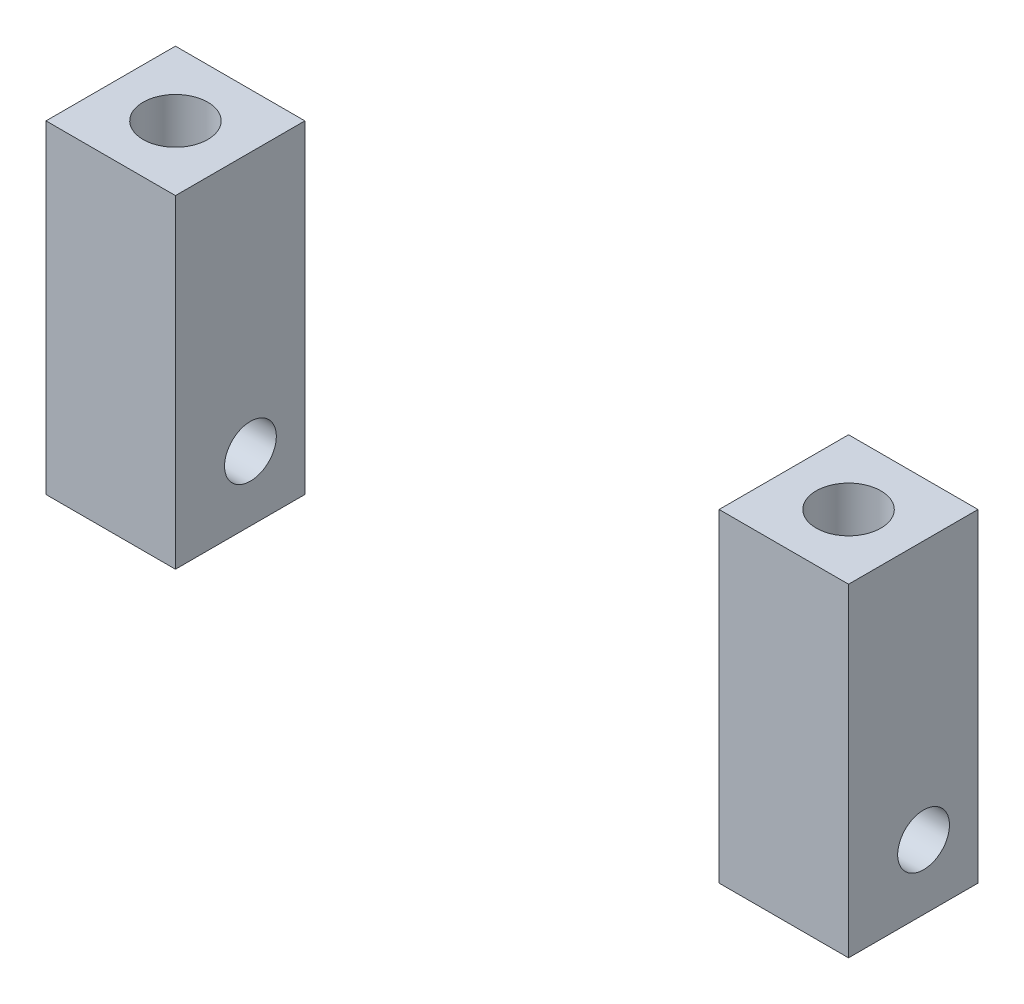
ISO-10303-21;
HEADER;
FILE_DESCRIPTION(('STEP AP214'),'2;1');
FILE_NAME('part.step','',(''),(''),'','','');
FILE_SCHEMA(('AUTOMOTIVE_DESIGN { 1 0 10303 214 1 1 1 1 }'));
ENDSEC;
DATA;
#1=APPLICATION_CONTEXT('core data for automotive mechanical design processes');
#2=APPLICATION_PROTOCOL_DEFINITION('international standard','automotive_design',2000,#1);
#3=PRODUCT_CONTEXT('',#1,'mechanical');
#4=PRODUCT('Part','Part','',(#3));
#5=PRODUCT_RELATED_PRODUCT_CATEGORY('part','',(#4));
#6=PRODUCT_DEFINITION_FORMATION('','',#4);
#7=PRODUCT_DEFINITION_CONTEXT('part definition',#1,'design');
#8=PRODUCT_DEFINITION('design','',#6,#7);
#9=PRODUCT_DEFINITION_SHAPE('','',#8);
#10=(LENGTH_UNIT() NAMED_UNIT(*) SI_UNIT(.MILLI.,.METRE.));
#11=(NAMED_UNIT(*) PLANE_ANGLE_UNIT() SI_UNIT($,.RADIAN.));
#12=(NAMED_UNIT(*) SI_UNIT($,.STERADIAN.) SOLID_ANGLE_UNIT());
#13=UNCERTAINTY_MEASURE_WITH_UNIT(LENGTH_MEASURE(1.E-05),#10,'distance_accuracy_value','');
#14=(GEOMETRIC_REPRESENTATION_CONTEXT(3) GLOBAL_UNCERTAINTY_ASSIGNED_CONTEXT((#13)) GLOBAL_UNIT_ASSIGNED_CONTEXT((#10,
#11,#12)) REPRESENTATION_CONTEXT('',''));
#15=CARTESIAN_POINT('',(0.,0.,0.));
#16=DIRECTION('',(0.,0.,1.));
#17=DIRECTION('',(1.,0.,0.));
#18=AXIS2_PLACEMENT_3D('',#15,#16,#17);
#19=CARTESIAN_POINT('',(-38.1949667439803,25.,-4.20544560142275));
#20=DIRECTION('',(-1.,0.,0.));
#21=DIRECTION('',(0.,0.,1.));
#22=AXIS2_PLACEMENT_3D('',#19,#20,#21);
#23=PLANE('',#22);
#24=CARTESIAN_POINT('',(-38.1949667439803,5.,0.));
#25=DIRECTION('',(-1.,0.,0.));
#26=DIRECTION('',(0.,0.,1.));
#27=AXIS2_PLACEMENT_3D('',#24,#25,#26);
#28=CIRCLE('',#27,2.);
#29=CARTESIAN_POINT('',(-38.1949667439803,5.,2.));
#30=VERTEX_POINT('',#29);
#31=EDGE_CURVE('E122',#30,#30,#28,.T.);
#32=ORIENTED_EDGE('',*,*,#31,.T.);
#33=EDGE_LOOP('',(#32));
#34=FACE_BOUND('',#33,.T.);
#35=DIRECTION('',(0.,0.,-1.));
#36=VECTOR('',#35,1.);
#37=CARTESIAN_POINT('',(-38.1949667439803,0.,-4.20544560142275));
#38=LINE('',#37,#36);
#39=CARTESIAN_POINT('',(-38.1949667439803,0.,5.79455439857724));
#40=VERTEX_POINT('',#39);
#41=CARTESIAN_POINT('',(-38.1949667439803,0.,-4.20544560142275));
#42=VERTEX_POINT('',#41);
#43=EDGE_CURVE('E105',#40,#42,#38,.T.);
#44=ORIENTED_EDGE('',*,*,#43,.T.);
#45=DIRECTION('',(0.,-1.,0.));
#46=VECTOR('',#45,1.);
#47=CARTESIAN_POINT('',(-38.1949667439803,25.,-4.20544560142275));
#48=LINE('',#47,#46);
#49=CARTESIAN_POINT('',(-38.1949667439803,25.,-4.20544560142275));
#50=VERTEX_POINT('',#49);
#51=EDGE_CURVE('E12',#50,#42,#48,.T.);
#52=ORIENTED_EDGE('',*,*,#51,.F.);
#53=DIRECTION('',(0.,0.,-1.));
#54=VECTOR('',#53,1.);
#55=CARTESIAN_POINT('',(-38.1949667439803,25.,-4.20544560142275));
#56=LINE('',#55,#54);
#57=CARTESIAN_POINT('',(-38.1949667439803,25.,5.79455439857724));
#58=VERTEX_POINT('',#57);
#59=EDGE_CURVE('E93',#58,#50,#56,.T.);
#60=ORIENTED_EDGE('',*,*,#59,.F.);
#61=DIRECTION('',(0.,-1.,0.));
#62=VECTOR('',#61,1.);
#63=CARTESIAN_POINT('',(-38.1949667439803,25.,5.79455439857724));
#64=LINE('',#63,#62);
#65=EDGE_CURVE('E101',#58,#40,#64,.T.);
#66=ORIENTED_EDGE('',*,*,#65,.T.);
#67=EDGE_LOOP('',(#44,#52,#60,#66));
#68=FACE_BOUND('',#67,.T.);
#69=ADVANCED_FACE('F42',(#34,#68),#23,.F.);
#70=CARTESIAN_POINT('',(-48.1949667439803,25.,-4.20544560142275));
#71=DIRECTION('',(0.,0.,1.));
#72=DIRECTION('',(1.,0.,0.));
#73=AXIS2_PLACEMENT_3D('',#70,#71,#72);
#74=PLANE('',#73);
#75=DIRECTION('',(-1.,0.,0.));
#76=VECTOR('',#75,1.);
#77=CARTESIAN_POINT('',(-48.1949667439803,0.,-4.20544560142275));
#78=LINE('',#77,#76);
#79=CARTESIAN_POINT('',(-48.1949667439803,0.,-4.20544560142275));
#80=VERTEX_POINT('',#79);
#81=EDGE_CURVE('E97',#42,#80,#78,.T.);
#82=ORIENTED_EDGE('',*,*,#81,.T.);
#83=DIRECTION('',(0.,-1.,0.));
#84=VECTOR('',#83,1.);
#85=CARTESIAN_POINT('',(-48.1949667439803,25.,-4.20544560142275));
#86=LINE('',#85,#84);
#87=CARTESIAN_POINT('',(-48.1949667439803,25.,-4.20544560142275));
#88=VERTEX_POINT('',#87);
#89=EDGE_CURVE('E50',#88,#80,#86,.T.);
#90=ORIENTED_EDGE('',*,*,#89,.F.);
#91=DIRECTION('',(-1.,0.,0.));
#92=VECTOR('',#91,1.);
#93=CARTESIAN_POINT('',(-48.1949667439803,25.,-4.20544560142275));
#94=LINE('',#93,#92);
#95=EDGE_CURVE('E88',#50,#88,#94,.T.);
#96=ORIENTED_EDGE('',*,*,#95,.F.);
#97=ORIENTED_EDGE('',*,*,#51,.T.);
#98=EDGE_LOOP('',(#82,#90,#96,#97));
#99=FACE_BOUND('',#98,.T.);
#100=ADVANCED_FACE('F96',(#99),#74,.F.);
#101=CARTESIAN_POINT('',(-48.1949667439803,25.,-4.20544560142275));
#102=DIRECTION('',(1.,0.,0.));
#103=DIRECTION('',(0.,0.,-1.));
#104=AXIS2_PLACEMENT_3D('',#101,#102,#103);
#105=PLANE('',#104);
#106=CARTESIAN_POINT('',(-48.1949667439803,5.,0.));
#107=DIRECTION('',(1.,0.,0.));
#108=DIRECTION('',(0.,0.,-1.));
#109=AXIS2_PLACEMENT_3D('',#106,#107,#108);
#110=CIRCLE('',#109,2.);
#111=CARTESIAN_POINT('',(-48.1949667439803,5.,-2.));
#112=VERTEX_POINT('',#111);
#113=EDGE_CURVE('E127',#112,#112,#110,.T.);
#114=ORIENTED_EDGE('',*,*,#113,.T.);
#115=EDGE_LOOP('',(#114));
#116=FACE_BOUND('',#115,.T.);
#117=DIRECTION('',(0.,0.,1.));
#118=VECTOR('',#117,1.);
#119=CARTESIAN_POINT('',(-48.1949667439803,0.,-4.20544560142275));
#120=LINE('',#119,#118);
#121=CARTESIAN_POINT('',(-48.1949667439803,0.,5.79455439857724));
#122=VERTEX_POINT('',#121);
#123=EDGE_CURVE('E75',#80,#122,#120,.T.);
#124=ORIENTED_EDGE('',*,*,#123,.T.);
#125=DIRECTION('',(0.,-1.,0.));
#126=VECTOR('',#125,1.);
#127=CARTESIAN_POINT('',(-48.1949667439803,25.,5.79455439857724));
#128=LINE('',#127,#126);
#129=CARTESIAN_POINT('',(-48.1949667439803,25.,5.79455439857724));
#130=VERTEX_POINT('',#129);
#131=EDGE_CURVE('E98',#130,#122,#128,.T.);
#132=ORIENTED_EDGE('',*,*,#131,.F.);
#133=DIRECTION('',(0.,0.,1.));
#134=VECTOR('',#133,1.);
#135=CARTESIAN_POINT('',(-48.1949667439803,25.,-4.20544560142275));
#136=LINE('',#135,#134);
#137=EDGE_CURVE('E91',#88,#130,#136,.T.);
#138=ORIENTED_EDGE('',*,*,#137,.F.);
#139=ORIENTED_EDGE('',*,*,#89,.T.);
#140=EDGE_LOOP('',(#124,#132,#138,#139));
#141=FACE_BOUND('',#140,.T.);
#142=ADVANCED_FACE('F99',(#116,#141),#105,.F.);
#143=CARTESIAN_POINT('',(-48.1949667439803,25.,5.79455439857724));
#144=DIRECTION('',(0.,0.,-1.));
#145=DIRECTION('',(-1.,0.,0.));
#146=AXIS2_PLACEMENT_3D('',#143,#144,#145);
#147=PLANE('',#146);
#148=DIRECTION('',(1.,0.,0.));
#149=VECTOR('',#148,1.);
#150=CARTESIAN_POINT('',(-48.1949667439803,0.,5.79455439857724));
#151=LINE('',#150,#149);
#152=EDGE_CURVE('E81',#122,#40,#151,.T.);
#153=ORIENTED_EDGE('',*,*,#152,.T.);
#154=ORIENTED_EDGE('',*,*,#65,.F.);
#155=DIRECTION('',(1.,0.,0.));
#156=VECTOR('',#155,1.);
#157=CARTESIAN_POINT('',(-48.1949667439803,25.,5.79455439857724));
#158=LINE('',#157,#156);
#159=EDGE_CURVE('E58',#130,#58,#158,.T.);
#160=ORIENTED_EDGE('',*,*,#159,.F.);
#161=ORIENTED_EDGE('',*,*,#131,.T.);
#162=EDGE_LOOP('',(#153,#154,#160,#161));
#163=FACE_BOUND('',#162,.T.);
#164=ADVANCED_FACE('F113',(#163),#147,.F.);
#165=CARTESIAN_POINT('',(0.,25.,0.));
#166=DIRECTION('',(0.,1.,0.));
#167=DIRECTION('',(0.,0.,1.));
#168=AXIS2_PLACEMENT_3D('',#165,#166,#167);
#169=PLANE('',#168);
#170=CARTESIAN_POINT('',(-43.1949667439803,25.,0.794554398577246));
#171=DIRECTION('',(0.,1.,0.));
#172=DIRECTION('',(0.,0.,1.));
#173=AXIS2_PLACEMENT_3D('',#170,#171,#172);
#174=CIRCLE('',#173,2.5);
#175=CARTESIAN_POINT('',(-43.1949667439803,25.,3.29455439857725));
#176=VERTEX_POINT('',#175);
#177=EDGE_CURVE('E119',#176,#176,#174,.T.);
#178=ORIENTED_EDGE('',*,*,#177,.F.);
#179=EDGE_LOOP('',(#178));
#180=FACE_BOUND('',#179,.T.);
#181=ORIENTED_EDGE('',*,*,#59,.T.);
#182=ORIENTED_EDGE('',*,*,#95,.T.);
#183=ORIENTED_EDGE('',*,*,#137,.T.);
#184=ORIENTED_EDGE('',*,*,#159,.T.);
#185=EDGE_LOOP('',(#181,#182,#183,#184));
#186=FACE_BOUND('',#185,.T.);
#187=ADVANCED_FACE('F89',(#180,#186),#169,.T.);
#188=CARTESIAN_POINT('',(0.,0.,0.));
#189=DIRECTION('',(0.,1.,0.));
#190=DIRECTION('',(0.,0.,1.));
#191=AXIS2_PLACEMENT_3D('',#188,#189,#190);
#192=PLANE('',#191);
#193=ORIENTED_EDGE('',*,*,#43,.F.);
#194=ORIENTED_EDGE('',*,*,#152,.F.);
#195=ORIENTED_EDGE('',*,*,#123,.F.);
#196=ORIENTED_EDGE('',*,*,#81,.F.);
#197=EDGE_LOOP('',(#193,#194,#195,#196));
#198=FACE_BOUND('',#197,.T.);
#199=ADVANCED_FACE('F116',(#198),#192,.F.);
#200=CARTESIAN_POINT('',(-43.1949667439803,10.,0.794554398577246));
#201=DIRECTION('',(0.,1.,0.));
#202=DIRECTION('',(0.,0.,1.));
#203=AXIS2_PLACEMENT_3D('',#200,#201,#202);
#204=CYLINDRICAL_SURFACE('',#203,2.5);
#205=CARTESIAN_POINT('',(-43.1949667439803,10.,0.794554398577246));
#206=DIRECTION('',(0.,1.,0.));
#207=DIRECTION('',(0.,0.,1.));
#208=AXIS2_PLACEMENT_3D('',#205,#206,#207);
#209=CIRCLE('',#208,2.5);
#210=CARTESIAN_POINT('',(-43.1949667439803,10.,3.29455439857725));
#211=VERTEX_POINT('',#210);
#212=EDGE_CURVE('E108',#211,#211,#209,.T.);
#213=ORIENTED_EDGE('',*,*,#212,.F.);
#214=EDGE_LOOP('',(#213));
#215=FACE_BOUND('',#214,.T.);
#216=ORIENTED_EDGE('',*,*,#177,.T.);
#217=EDGE_LOOP('',(#216));
#218=FACE_BOUND('',#217,.T.);
#219=ADVANCED_FACE('F152',(#215,#218),#204,.F.);
#220=CARTESIAN_POINT('',(-43.1949667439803,10.,0.794554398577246));
#221=DIRECTION('',(0.,1.,0.));
#222=DIRECTION('',(0.,0.,1.));
#223=AXIS2_PLACEMENT_3D('',#220,#221,#222);
#224=PLANE('',#223);
#225=ORIENTED_EDGE('',*,*,#212,.T.);
#226=EDGE_LOOP('',(#225));
#227=FACE_BOUND('',#226,.T.);
#228=ADVANCED_FACE('F135',(#227),#224,.T.);
#229=CARTESIAN_POINT('',(-48.1949667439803,5.,0.));
#230=DIRECTION('',(1.,0.,0.));
#231=DIRECTION('',(0.,0.,-1.));
#232=AXIS2_PLACEMENT_3D('',#229,#230,#231);
#233=CYLINDRICAL_SURFACE('',#232,2.);
#234=ORIENTED_EDGE('',*,*,#113,.F.);
#235=EDGE_LOOP('',(#234));
#236=FACE_BOUND('',#235,.T.);
#237=ORIENTED_EDGE('',*,*,#31,.F.);
#238=EDGE_LOOP('',(#237));
#239=FACE_BOUND('',#238,.T.);
#240=ADVANCED_FACE('F132',(#236,#239),#233,.F.);
#241=CLOSED_SHELL('',(#69,#100,#142,#164,#187,#199,#219,#228,#240));
#242=MANIFOLD_SOLID_BREP('B2',#241);
#243=CARTESIAN_POINT('',(13.8050332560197,25.,-4.20544560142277));
#244=DIRECTION('',(-1.,0.,0.));
#245=DIRECTION('',(0.,0.,1.));
#246=AXIS2_PLACEMENT_3D('',#243,#244,#245);
#247=PLANE('',#246);
#248=CARTESIAN_POINT('',(13.8050332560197,5.,0.));
#249=DIRECTION('',(1.,0.,0.));
#250=DIRECTION('',(0.,0.,-1.));
#251=AXIS2_PLACEMENT_3D('',#248,#249,#250);
#252=CIRCLE('',#251,2.);
#253=CARTESIAN_POINT('',(13.8050332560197,5.,-2.));
#254=VERTEX_POINT('',#253);
#255=EDGE_CURVE('E300',#254,#254,#252,.T.);
#256=ORIENTED_EDGE('',*,*,#255,.F.);
#257=EDGE_LOOP('',(#256));
#258=FACE_BOUND('',#257,.T.);
#259=DIRECTION('',(0.,0.,-1.));
#260=VECTOR('',#259,1.);
#261=CARTESIAN_POINT('',(13.8050332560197,0.,-4.20544560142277));
#262=LINE('',#261,#260);
#263=CARTESIAN_POINT('',(13.8050332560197,0.,5.79455439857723));
#264=VERTEX_POINT('',#263);
#265=CARTESIAN_POINT('',(13.8050332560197,0.,-4.20544560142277));
#266=VERTEX_POINT('',#265);
#267=EDGE_CURVE('E281',#264,#266,#262,.T.);
#268=ORIENTED_EDGE('',*,*,#267,.T.);
#269=DIRECTION('',(0.,-1.,0.));
#270=VECTOR('',#269,1.);
#271=CARTESIAN_POINT('',(13.8050332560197,25.,-4.20544560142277));
#272=LINE('',#271,#270);
#273=CARTESIAN_POINT('',(13.8050332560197,25.,-4.20544560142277));
#274=VERTEX_POINT('',#273);
#275=EDGE_CURVE('E40',#274,#266,#272,.T.);
#276=ORIENTED_EDGE('',*,*,#275,.F.);
#277=DIRECTION('',(0.,0.,-1.));
#278=VECTOR('',#277,1.);
#279=CARTESIAN_POINT('',(13.8050332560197,25.,-4.20544560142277));
#280=LINE('',#279,#278);
#281=CARTESIAN_POINT('',(13.8050332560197,25.,5.79455439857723));
#282=VERTEX_POINT('',#281);
#283=EDGE_CURVE('E268',#282,#274,#280,.T.);
#284=ORIENTED_EDGE('',*,*,#283,.F.);
#285=DIRECTION('',(0.,-1.,0.));
#286=VECTOR('',#285,1.);
#287=CARTESIAN_POINT('',(13.8050332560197,25.,5.79455439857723));
#288=LINE('',#287,#286);
#289=EDGE_CURVE('E277',#282,#264,#288,.T.);
#290=ORIENTED_EDGE('',*,*,#289,.T.);
#291=EDGE_LOOP('',(#268,#276,#284,#290));
#292=FACE_BOUND('',#291,.T.);
#293=ADVANCED_FACE('F216',(#258,#292),#247,.F.);
#294=CARTESIAN_POINT('',(13.8050332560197,25.,-4.20544560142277));
#295=DIRECTION('',(0.,0.,1.));
#296=DIRECTION('',(1.,0.,0.));
#297=AXIS2_PLACEMENT_3D('',#294,#295,#296);
#298=PLANE('',#297);
#299=DIRECTION('',(-1.,0.,0.));
#300=VECTOR('',#299,1.);
#301=CARTESIAN_POINT('',(13.8050332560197,0.,-4.20544560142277));
#302=LINE('',#301,#300);
#303=CARTESIAN_POINT('',(3.80503325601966,0.,-4.20544560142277));
#304=VERTEX_POINT('',#303);
#305=EDGE_CURVE('E272',#266,#304,#302,.T.);
#306=ORIENTED_EDGE('',*,*,#305,.T.);
#307=DIRECTION('',(0.,-1.,0.));
#308=VECTOR('',#307,1.);
#309=CARTESIAN_POINT('',(3.80503325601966,25.,-4.20544560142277));
#310=LINE('',#309,#308);
#311=CARTESIAN_POINT('',(3.80503325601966,25.,-4.20544560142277));
#312=VERTEX_POINT('',#311);
#313=EDGE_CURVE('E225',#312,#304,#310,.T.);
#314=ORIENTED_EDGE('',*,*,#313,.F.);
#315=DIRECTION('',(-1.,0.,0.));
#316=VECTOR('',#315,1.);
#317=CARTESIAN_POINT('',(13.8050332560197,25.,-4.20544560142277));
#318=LINE('',#317,#316);
#319=EDGE_CURVE('E263',#274,#312,#318,.T.);
#320=ORIENTED_EDGE('',*,*,#319,.F.);
#321=ORIENTED_EDGE('',*,*,#275,.T.);
#322=EDGE_LOOP('',(#306,#314,#320,#321));
#323=FACE_BOUND('',#322,.T.);
#324=ADVANCED_FACE('F271',(#323),#298,.F.);
#325=CARTESIAN_POINT('',(3.80503325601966,25.,-4.20544560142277));
#326=DIRECTION('',(1.,0.,0.));
#327=DIRECTION('',(0.,0.,-1.));
#328=AXIS2_PLACEMENT_3D('',#325,#326,#327);
#329=PLANE('',#328);
#330=CARTESIAN_POINT('',(3.80503325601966,5.,0.));
#331=DIRECTION('',(1.,0.,0.));
#332=DIRECTION('',(0.,0.,-1.));
#333=AXIS2_PLACEMENT_3D('',#330,#331,#332);
#334=CIRCLE('',#333,2.);
#335=CARTESIAN_POINT('',(3.80503325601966,5.,-2.));
#336=VERTEX_POINT('',#335);
#337=EDGE_CURVE('E219',#336,#336,#334,.T.);
#338=ORIENTED_EDGE('',*,*,#337,.T.);
#339=EDGE_LOOP('',(#338));
#340=FACE_BOUND('',#339,.T.);
#341=DIRECTION('',(0.,0.,1.));
#342=VECTOR('',#341,1.);
#343=CARTESIAN_POINT('',(3.80503325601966,0.,-4.20544560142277));
#344=LINE('',#343,#342);
#345=CARTESIAN_POINT('',(3.80503325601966,0.,5.79455439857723));
#346=VERTEX_POINT('',#345);
#347=EDGE_CURVE('E250',#304,#346,#344,.T.);
#348=ORIENTED_EDGE('',*,*,#347,.T.);
#349=DIRECTION('',(0.,-1.,0.));
#350=VECTOR('',#349,1.);
#351=CARTESIAN_POINT('',(3.80503325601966,25.,5.79455439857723));
#352=LINE('',#351,#350);
#353=CARTESIAN_POINT('',(3.80503325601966,25.,5.79455439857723));
#354=VERTEX_POINT('',#353);
#355=EDGE_CURVE('E273',#354,#346,#352,.T.);
#356=ORIENTED_EDGE('',*,*,#355,.F.);
#357=DIRECTION('',(0.,0.,1.));
#358=VECTOR('',#357,1.);
#359=CARTESIAN_POINT('',(3.80503325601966,25.,-4.20544560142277));
#360=LINE('',#359,#358);
#361=EDGE_CURVE('E266',#312,#354,#360,.T.);
#362=ORIENTED_EDGE('',*,*,#361,.F.);
#363=ORIENTED_EDGE('',*,*,#313,.T.);
#364=EDGE_LOOP('',(#348,#356,#362,#363));
#365=FACE_BOUND('',#364,.T.);
#366=ADVANCED_FACE('F275',(#340,#365),#329,.F.);
#367=CARTESIAN_POINT('',(13.8050332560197,25.,5.79455439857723));
#368=DIRECTION('',(0.,0.,-1.));
#369=DIRECTION('',(-1.,0.,0.));
#370=AXIS2_PLACEMENT_3D('',#367,#368,#369);
#371=PLANE('',#370);
#372=DIRECTION('',(1.,0.,0.));
#373=VECTOR('',#372,1.);
#374=CARTESIAN_POINT('',(13.8050332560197,0.,5.79455439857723));
#375=LINE('',#374,#373);
#376=EDGE_CURVE('E256',#346,#264,#375,.T.);
#377=ORIENTED_EDGE('',*,*,#376,.T.);
#378=ORIENTED_EDGE('',*,*,#289,.F.);
#379=DIRECTION('',(1.,0.,0.));
#380=VECTOR('',#379,1.);
#381=CARTESIAN_POINT('',(13.8050332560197,25.,5.79455439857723));
#382=LINE('',#381,#380);
#383=EDGE_CURVE('E233',#354,#282,#382,.T.);
#384=ORIENTED_EDGE('',*,*,#383,.F.);
#385=ORIENTED_EDGE('',*,*,#355,.T.);
#386=EDGE_LOOP('',(#377,#378,#384,#385));
#387=FACE_BOUND('',#386,.T.);
#388=ADVANCED_FACE('F289',(#387),#371,.F.);
#389=CARTESIAN_POINT('',(0.,25.,0.));
#390=DIRECTION('',(0.,-1.,0.));
#391=DIRECTION('',(0.,0.,-1.));
#392=AXIS2_PLACEMENT_3D('',#389,#390,#391);
#393=PLANE('',#392);
#394=CARTESIAN_POINT('',(8.80503325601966,25.,0.794554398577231));
#395=DIRECTION('',(0.,1.,0.));
#396=DIRECTION('',(0.,0.,1.));
#397=AXIS2_PLACEMENT_3D('',#394,#395,#396);
#398=CIRCLE('',#397,2.5);
#399=CARTESIAN_POINT('',(8.80503325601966,25.,3.29455439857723));
#400=VERTEX_POINT('',#399);
#401=EDGE_CURVE('E295',#400,#400,#398,.T.);
#402=ORIENTED_EDGE('',*,*,#401,.F.);
#403=EDGE_LOOP('',(#402));
#404=FACE_BOUND('',#403,.T.);
#405=ORIENTED_EDGE('',*,*,#283,.T.);
#406=ORIENTED_EDGE('',*,*,#319,.T.);
#407=ORIENTED_EDGE('',*,*,#361,.T.);
#408=ORIENTED_EDGE('',*,*,#383,.T.);
#409=EDGE_LOOP('',(#405,#406,#407,#408));
#410=FACE_BOUND('',#409,.T.);
#411=ADVANCED_FACE('F264',(#404,#410),#393,.F.);
#412=CARTESIAN_POINT('',(0.,0.,0.));
#413=DIRECTION('',(0.,-1.,0.));
#414=DIRECTION('',(0.,0.,-1.));
#415=AXIS2_PLACEMENT_3D('',#412,#413,#414);
#416=PLANE('',#415);
#417=ORIENTED_EDGE('',*,*,#267,.F.);
#418=ORIENTED_EDGE('',*,*,#376,.F.);
#419=ORIENTED_EDGE('',*,*,#347,.F.);
#420=ORIENTED_EDGE('',*,*,#305,.F.);
#421=EDGE_LOOP('',(#417,#418,#419,#420));
#422=FACE_BOUND('',#421,.T.);
#423=ADVANCED_FACE('F292',(#422),#416,.T.);
#424=CARTESIAN_POINT('',(8.80503325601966,10.,0.794554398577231));
#425=DIRECTION('',(0.,1.,0.));
#426=DIRECTION('',(0.,0.,1.));
#427=AXIS2_PLACEMENT_3D('',#424,#425,#426);
#428=CYLINDRICAL_SURFACE('',#427,2.5);
#429=CARTESIAN_POINT('',(8.80503325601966,10.,0.794554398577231));
#430=DIRECTION('',(0.,1.,0.));
#431=DIRECTION('',(0.,0.,1.));
#432=AXIS2_PLACEMENT_3D('',#429,#430,#431);
#433=CIRCLE('',#432,2.5);
#434=CARTESIAN_POINT('',(8.80503325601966,10.,3.29455439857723));
#435=VERTEX_POINT('',#434);
#436=EDGE_CURVE('E284',#435,#435,#433,.T.);
#437=ORIENTED_EDGE('',*,*,#436,.F.);
#438=EDGE_LOOP('',(#437));
#439=FACE_BOUND('',#438,.T.);
#440=ORIENTED_EDGE('',*,*,#401,.T.);
#441=EDGE_LOOP('',(#440));
#442=FACE_BOUND('',#441,.T.);
#443=ADVANCED_FACE('F315',(#439,#442),#428,.F.);
#444=CARTESIAN_POINT('',(8.80503325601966,10.,0.794554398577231));
#445=DIRECTION('',(0.,1.,0.));
#446=DIRECTION('',(0.,0.,1.));
#447=AXIS2_PLACEMENT_3D('',#444,#445,#446);
#448=PLANE('',#447);
#449=ORIENTED_EDGE('',*,*,#436,.T.);
#450=EDGE_LOOP('',(#449));
#451=FACE_BOUND('',#450,.T.);
#452=ADVANCED_FACE('F310',(#451),#448,.T.);
#453=CARTESIAN_POINT('',(-48.1949667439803,5.,0.));
#454=DIRECTION('',(1.,0.,0.));
#455=DIRECTION('',(0.,0.,-1.));
#456=AXIS2_PLACEMENT_3D('',#453,#454,#455);
#457=CYLINDRICAL_SURFACE('',#456,2.);
#458=ORIENTED_EDGE('',*,*,#255,.T.);
#459=EDGE_LOOP('',(#458));
#460=FACE_BOUND('',#459,.T.);
#461=ORIENTED_EDGE('',*,*,#337,.F.);
#462=EDGE_LOOP('',(#461));
#463=FACE_BOUND('',#462,.T.);
#464=ADVANCED_FACE('F308',(#460,#463),#457,.F.);
#465=CLOSED_SHELL('',(#293,#324,#366,#388,#411,#423,#443,#452,#464));
#466=MANIFOLD_SOLID_BREP('B6',#465);
#467=ADVANCED_BREP_SHAPE_REPRESENTATION('',(#18,#242,#466),#14);
#468=SHAPE_DEFINITION_REPRESENTATION(#9,#467);
ENDSEC;
END-ISO-10303-21;
